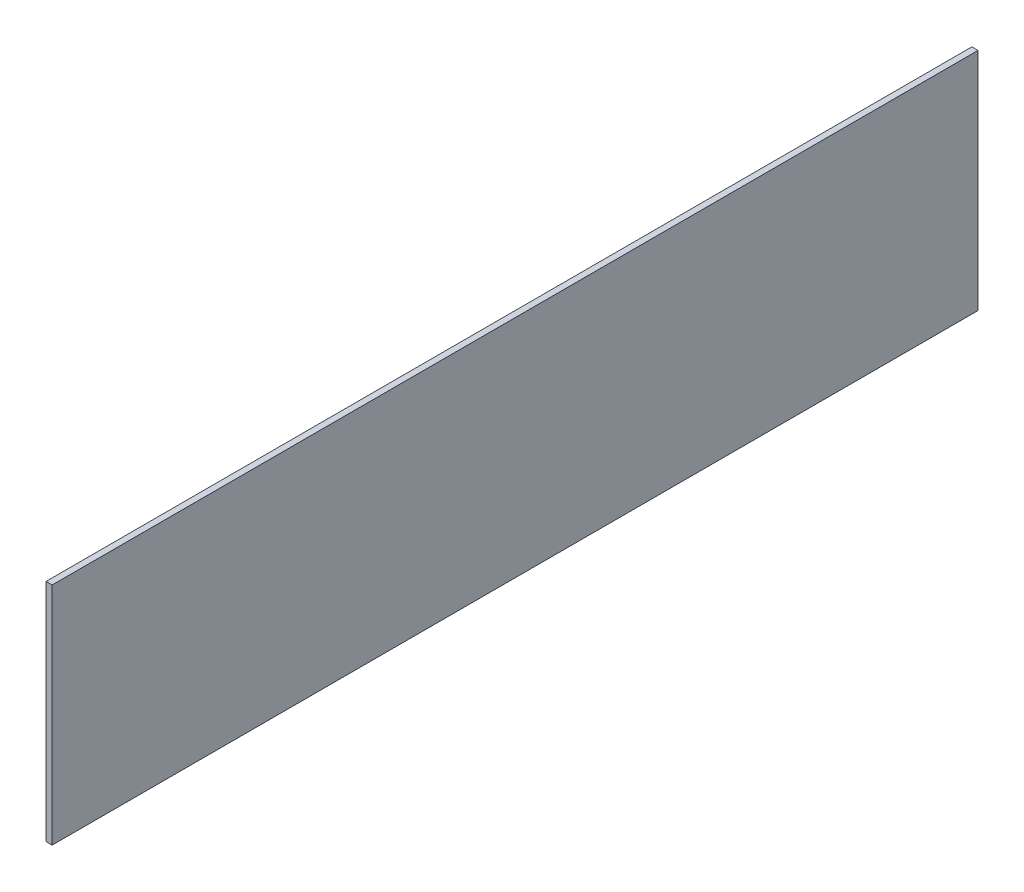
from build123d import *

# Parameters (mm, degrees)
SKETCH1_W           = 452
SKETCH1_H           = 110
BOSS_EXTRUDE1_DEPTH = 3


with BuildPart() as part:
    # Sketch1 → Boss-Extrude1 (new body)
    with BuildSketch(Plane(origin=(0, 0, 0), x_dir=(0, 0, -1), z_dir=(1, 0, 0))):
        with Locations((226, 55)):
            Rectangle(SKETCH1_W, SKETCH1_H)
    extrude(amount=BOSS_EXTRUDE1_DEPTH)


solid = part.part
